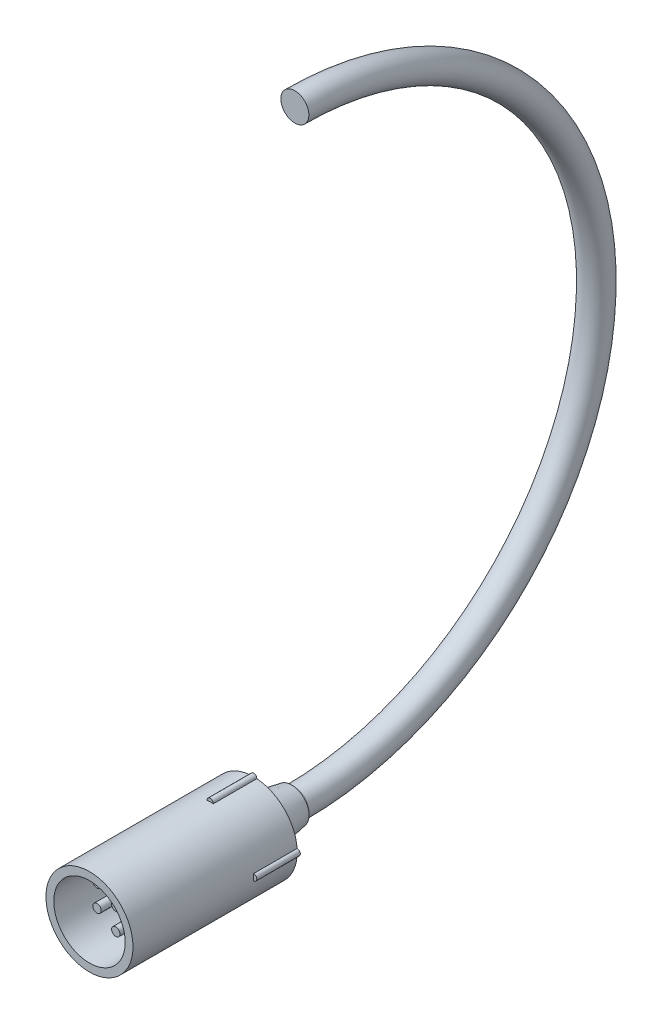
from build123d import *

# Parameters (mm, degrees)
SKETCH1_R                   = 7.747
EXTRUDE1_DEPTH              = 19.05
SKETCH6_R                   = 1.38195305
EXTRUDE4_DEPTH              = 9.525
SKETCH7_R                   = 1.06048512
EXTRUDE5_DEPTH              = 4.7625
CIRPATTERN1_COUNT           = 6
SKETCH8_R                   = 1.440699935
EXTRUDE6_DEPTH              = 9.525
SKETCH9_R                   = 1.068562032
EXTRUDE7_DEPTH              = 4.7625
SKETCH2_R                   = 6.352807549
EXTRUDE2_DEPTH              = 11.1125
EXTRUDE2_TAPER              = 10
SKETCH3_R                   = 3.5433
EXTRUDE3_DEPTH              = 0.79375
EXTRUDE8_DEPTH              = 11
CIRPATTERN2_COUNT           = 4
SKETCH5_R                   = 3.5433
BELDEN_3120ATYPE3PR24_ANGLE = 180


with BuildPart() as part:
    # Sketch1 → Extrude1 (new body)
    with BuildSketch(Plane.XY):
        Circle(SKETCH1_R)
    extrude(amount=-EXTRUDE1_DEPTH)

    # Sketch6 → Extrude4 (add)
    with BuildSketch(Plane.XY):
        with Locations((0, -5.484679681)):
            Circle(SKETCH6_R)
    extrude4 = extrude(amount=EXTRUDE4_DEPTH)

    # Sketch7 → Extrude5 (add)
    with BuildSketch(Plane.XY.offset(9.525)):
        with Locations((0, -5.484679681)):
            Circle(SKETCH7_R)
    extrude5 = extrude(amount=EXTRUDE5_DEPTH)

    # CirPattern1: Extrude4, Extrude5 ×6 about axis, 1 skipped
    cirpattern1_axis = Axis((0, 0, 0), (0, 0, 1))
    add([extrude4.rotate(cirpattern1_axis, i * 360 / CIRPATTERN1_COUNT) for i in range(1, CIRPATTERN1_COUNT) if i not in (3,)])
    add([extrude5.rotate(cirpattern1_axis, i * 360 / CIRPATTERN1_COUNT) for i in range(1, CIRPATTERN1_COUNT) if i not in (3,)])

    # Sketch8 → Extrude6 (add)
    with BuildSketch(Plane.XY):
        with Locations(Location((0, 0, 0), (0, 0, 180))):
            Circle(SKETCH8_R)
    extrude(amount=EXTRUDE6_DEPTH)

    # Sketch9 → Extrude7 (add)
    with BuildSketch(Plane.XY.offset(9.525)):
        Circle(SKETCH9_R)
    extrude(amount=EXTRUDE7_DEPTH)

    # Sketch2 → Extrude2 (add)
    with BuildSketch(Plane(origin=(0, 0, -19.05), x_dir=(-1, 0, 0), z_dir=(0, 0, -1))):
        Circle(SKETCH2_R)
    extrude(amount=EXTRUDE2_DEPTH, taper=EXTRUDE2_TAPER)

    # Sketch3 → Extrude3 (add)
    with BuildSketch(Plane(origin=(0, 0, -30.1625), x_dir=(-1, 0, 0), z_dir=(0, 0, -1))):
        Circle(SKETCH3_R)
    extrude(amount=EXTRUDE3_DEPTH)

    # Sketch5 → Belden 3120AType3PR24 (revolve)
    with BuildSketch(Plane(origin=(0, 0, -30.95625), x_dir=(-1, 0, 0), z_dir=(0, 0, -1))):
        with Locations(Location((0, 0, 0), (0, 0, 270))):
            Circle(SKETCH5_R)
    revolve(axis=Axis((-38.976720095, 76.2, -30.95625), (1, 0, 0)), revolution_arc=BELDEN_3120ATYPE3PR24_ANGLE)


with BuildPart() as body_2:
    # Sketch10 → Revolve2 (revolve)
    with BuildSketch(Plane(origin=(0, 0, 0), x_dir=(0, 0, -1), z_dir=(1, 0, 0)), mode=Mode.PRIVATE) as revolve2_sk:
        Polygon((19.056845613, 6.248916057), (19.056845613, 8.156974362), (-2.09947416, 8.156974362), (-2.09947416, 9.027797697), (-20.940012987, 9.027797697), (-20.940012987, 11), (20.559987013, 11), (20.559987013, 6.248916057), align=None)
    revolve(revolve2_sk.sketch.rotate(Axis((0, 0, 0), (0, 0, -1)), 90), axis=Axis((0, 0, 0), (0, 0, -1)))

    # Sketch12 → Extrude8 (add)
    with BuildSketch(Plane(origin=(0, 0, -20.559987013), x_dir=(-1, 0, 0), z_dir=(0, 0, -1))):
        with BuildLine():
            ThreePointArc((0.787297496, 10.971789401), (0, 11.787802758), (-0.787297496, 10.971789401))
            ThreePointArc((-0.787297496, 10.971789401), (0, 11), (0.787297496, 10.971789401))
        make_face()
    extrude8 = extrude(amount=-EXTRUDE8_DEPTH)

    # CirPattern2: Extrude8 ×4 about axis
    cirpattern2_axis = Axis((0, 0, 0), (0, 0, 1))
    for i in range(1, CIRPATTERN2_COUNT):
        add(extrude8.rotate(cirpattern2_axis, i * 360 / CIRPATTERN2_COUNT))


solid = Compound([part.part, body_2.part])
